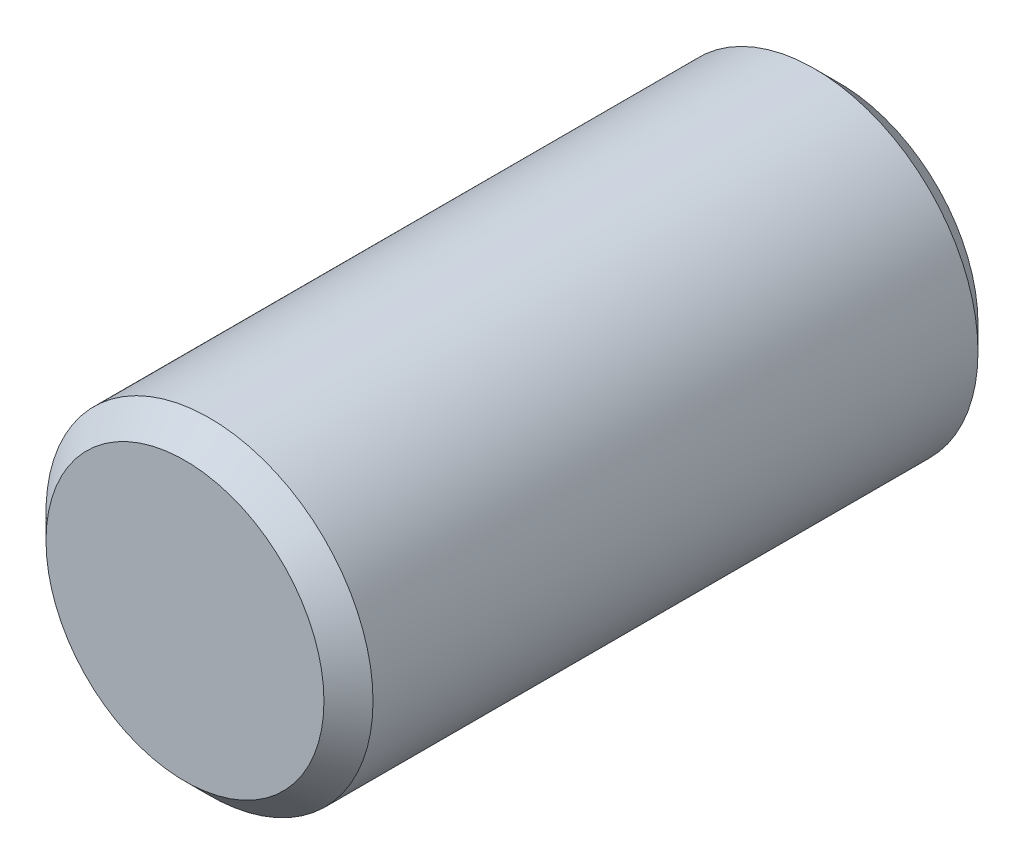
from build123d import *

# Parameters (mm, degrees)
ESQUISSE1_R             = 2
BASE_EXTRUSION_DEPTH    = 8
ENL_V_MAT_EXTRU_1_DEPTH = 2
CHANFREIN1_SIZE         = 0.3


with BuildPart() as part:
    # Esquisse1 → Base-Extrusion (new body)
    with BuildSketch(Plane.XY):
        Circle(ESQUISSE1_R)
    extrude(amount=-BASE_EXTRUSION_DEPTH)

    # Esquisse2 → Enl_v. mat.-Extru.1 (cut)
    with BuildSketch(Plane(origin=(0, 0, -8), x_dir=(-1, 0, 0), z_dir=(0, 0, -1))):
        Polygon((1.154700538, 0), (0.577350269, 1), (-0.577350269, 1), (-1.154700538, 0), (-0.577350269, -1), (0.577350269, -1), align=None)
    extrude(amount=-ENL_V_MAT_EXTRU_1_DEPTH, mode=Mode.SUBTRACT)

    # Chanfrein1
    chanfrein1_edges = [part.edges().sort_by_distance(p)[0] for p in [
        (-2, 0, 0),
        (-2, 0, -8),
    ]]
    chamfer(chanfrein1_edges, length=CHANFREIN1_SIZE)


solid = part.part
